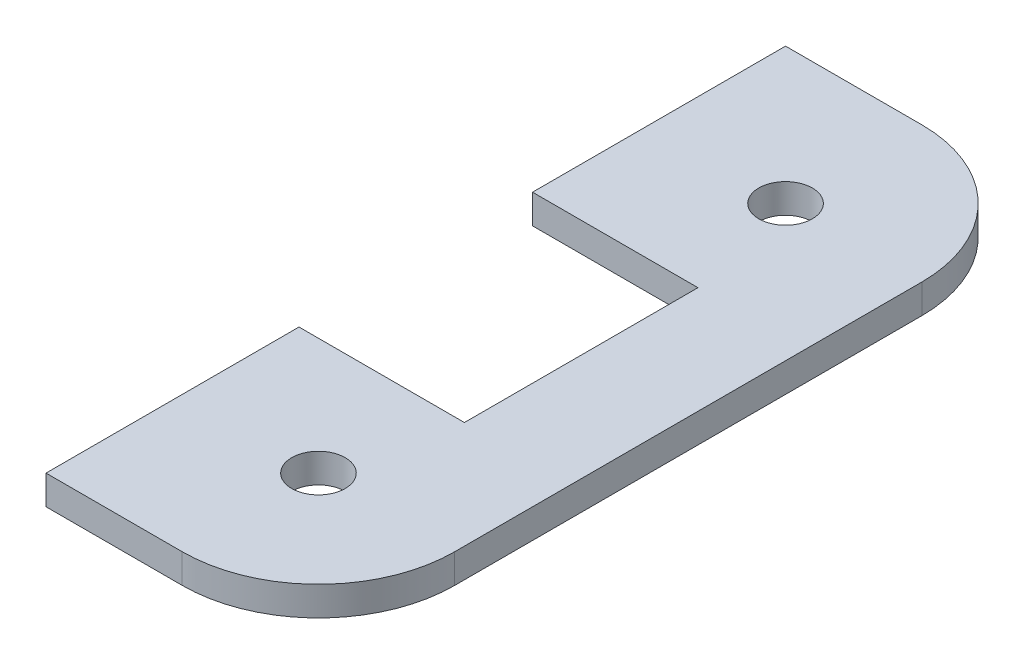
ISO-10303-21;
HEADER;
FILE_DESCRIPTION(('STEP AP214'),'2;1');
FILE_NAME('part.step','',(''),(''),'','','');
FILE_SCHEMA(('AUTOMOTIVE_DESIGN { 1 0 10303 214 1 1 1 1 }'));
ENDSEC;
DATA;
#1=APPLICATION_CONTEXT('core data for automotive mechanical design processes');
#2=APPLICATION_PROTOCOL_DEFINITION('international standard','automotive_design',2000,#1);
#3=PRODUCT_CONTEXT('',#1,'mechanical');
#4=PRODUCT('Part','Part','',(#3));
#5=PRODUCT_RELATED_PRODUCT_CATEGORY('part','',(#4));
#6=PRODUCT_DEFINITION_FORMATION('','',#4);
#7=PRODUCT_DEFINITION_CONTEXT('part definition',#1,'design');
#8=PRODUCT_DEFINITION('design','',#6,#7);
#9=PRODUCT_DEFINITION_SHAPE('','',#8);
#10=(LENGTH_UNIT() NAMED_UNIT(*) SI_UNIT(.MILLI.,.METRE.));
#11=(NAMED_UNIT(*) PLANE_ANGLE_UNIT() SI_UNIT($,.RADIAN.));
#12=(NAMED_UNIT(*) SI_UNIT($,.STERADIAN.) SOLID_ANGLE_UNIT());
#13=UNCERTAINTY_MEASURE_WITH_UNIT(LENGTH_MEASURE(1.E-05),#10,'distance_accuracy_value','');
#14=(GEOMETRIC_REPRESENTATION_CONTEXT(3) GLOBAL_UNCERTAINTY_ASSIGNED_CONTEXT((#13)) GLOBAL_UNIT_ASSIGNED_CONTEXT((#10,
#11,#12)) REPRESENTATION_CONTEXT('',''));
#15=CARTESIAN_POINT('',(0.,0.,0.));
#16=DIRECTION('',(0.,0.,1.));
#17=DIRECTION('',(1.,0.,0.));
#18=AXIS2_PLACEMENT_3D('',#15,#16,#17);
#19=CARTESIAN_POINT('',(14.,3.,-62.));
#20=DIRECTION('',(0.,1.,0.));
#21=DIRECTION('',(0.,0.,1.));
#22=AXIS2_PLACEMENT_3D('',#19,#20,#21);
#23=PLANE('',#22);
#24=CARTESIAN_POINT('',(14.,3.,-14.));
#25=DIRECTION('',(0.,1.,0.));
#26=DIRECTION('',(0.,0.,-1.));
#27=AXIS2_PLACEMENT_3D('',#24,#25,#26);
#28=CIRCLE('',#27,2.74999999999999);
#29=CARTESIAN_POINT('',(14.,3.,-16.75));
#30=VERTEX_POINT('',#29);
#31=EDGE_CURVE('E144',#30,#30,#28,.T.);
#32=ORIENTED_EDGE('',*,*,#31,.F.);
#33=EDGE_LOOP('',(#32));
#34=FACE_BOUND('',#33,.T.);
#35=DIRECTION('',(1.,0.,0.));
#36=VECTOR('',#35,1.);
#37=CARTESIAN_POINT('',(13.9999999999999,3.,0.));
#38=LINE('',#37,#36);
#39=CARTESIAN_POINT('',(0.,3.,0.));
#40=VERTEX_POINT('',#39);
#41=CARTESIAN_POINT('',(13.9999999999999,3.,0.));
#42=VERTEX_POINT('',#41);
#43=EDGE_CURVE('E159',#40,#42,#38,.T.);
#44=ORIENTED_EDGE('',*,*,#43,.T.);
#45=CARTESIAN_POINT('',(14.,3.,-14.));
#46=DIRECTION('',(0.,1.,0.));
#47=DIRECTION('',(0.,0.,1.));
#48=AXIS2_PLACEMENT_3D('',#45,#46,#47);
#49=CIRCLE('',#48,14.);
#50=CARTESIAN_POINT('',(28.,3.,-14.));
#51=VERTEX_POINT('',#50);
#52=EDGE_CURVE('E97',#42,#51,#49,.T.);
#53=ORIENTED_EDGE('',*,*,#52,.T.);
#54=DIRECTION('',(0.,0.,-1.));
#55=VECTOR('',#54,1.);
#56=CARTESIAN_POINT('',(28.,3.,-14.));
#57=LINE('',#56,#55);
#58=CARTESIAN_POINT('',(28.,3.,-61.9999999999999));
#59=VERTEX_POINT('',#58);
#60=EDGE_CURVE('E180',#51,#59,#57,.T.);
#61=ORIENTED_EDGE('',*,*,#60,.T.);
#62=CARTESIAN_POINT('',(14.,3.,-62.));
#63=DIRECTION('',(0.,1.,0.));
#64=DIRECTION('',(0.,0.,1.));
#65=AXIS2_PLACEMENT_3D('',#62,#63,#64);
#66=CIRCLE('',#65,14.);
#67=CARTESIAN_POINT('',(14.,3.,-75.9999999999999));
#68=VERTEX_POINT('',#67);
#69=EDGE_CURVE('E199',#59,#68,#66,.T.);
#70=ORIENTED_EDGE('',*,*,#69,.T.);
#71=DIRECTION('',(-1.,0.,0.));
#72=VECTOR('',#71,1.);
#73=CARTESIAN_POINT('',(14.,3.,-75.9999999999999));
#74=LINE('',#73,#72);
#75=CARTESIAN_POINT('',(0.,3.,-75.9999999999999));
#76=VERTEX_POINT('',#75);
#77=EDGE_CURVE('E196',#68,#76,#74,.T.);
#78=ORIENTED_EDGE('',*,*,#77,.T.);
#79=DIRECTION('',(0.,0.,1.));
#80=VECTOR('',#79,1.);
#81=CARTESIAN_POINT('',(0.,3.,-50.));
#82=LINE('',#81,#80);
#83=CARTESIAN_POINT('',(0.,3.,-50.));
#84=VERTEX_POINT('',#83);
#85=EDGE_CURVE('E198',#76,#84,#82,.T.);
#86=ORIENTED_EDGE('',*,*,#85,.T.);
#87=DIRECTION('',(1.,0.,0.));
#88=VECTOR('',#87,1.);
#89=CARTESIAN_POINT('',(0.,3.,-50.));
#90=LINE('',#89,#88);
#91=CARTESIAN_POINT('',(17.,3.,-50.));
#92=VERTEX_POINT('',#91);
#93=EDGE_CURVE('E122',#84,#92,#90,.T.);
#94=ORIENTED_EDGE('',*,*,#93,.T.);
#95=DIRECTION('',(0.,0.,1.));
#96=VECTOR('',#95,1.);
#97=CARTESIAN_POINT('',(17.,3.,-50.));
#98=LINE('',#97,#96);
#99=CARTESIAN_POINT('',(17.,3.,-26.));
#100=VERTEX_POINT('',#99);
#101=EDGE_CURVE('E116',#92,#100,#98,.T.);
#102=ORIENTED_EDGE('',*,*,#101,.T.);
#103=DIRECTION('',(-1.,0.,0.));
#104=VECTOR('',#103,1.);
#105=CARTESIAN_POINT('',(0.,3.,-26.));
#106=LINE('',#105,#104);
#107=CARTESIAN_POINT('',(0.,3.,-26.));
#108=VERTEX_POINT('',#107);
#109=EDGE_CURVE('E120',#100,#108,#106,.T.);
#110=ORIENTED_EDGE('',*,*,#109,.T.);
#111=DIRECTION('',(0.,0.,1.));
#112=VECTOR('',#111,1.);
#113=CARTESIAN_POINT('',(0.,3.,0.));
#114=LINE('',#113,#112);
#115=EDGE_CURVE('E48',#108,#40,#114,.T.);
#116=ORIENTED_EDGE('',*,*,#115,.T.);
#117=EDGE_LOOP('',(#44,#53,#61,#70,#78,#86,#94,#102,#110,#116));
#118=FACE_BOUND('',#117,.T.);
#119=CARTESIAN_POINT('',(14.,3.,-62.));
#120=DIRECTION('',(0.,1.,0.));
#121=DIRECTION('',(0.,0.,-1.));
#122=AXIS2_PLACEMENT_3D('',#119,#120,#121);
#123=CIRCLE('',#122,2.74999999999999);
#124=CARTESIAN_POINT('',(14.,3.,-64.75));
#125=VERTEX_POINT('',#124);
#126=EDGE_CURVE('E210',#125,#125,#123,.T.);
#127=ORIENTED_EDGE('',*,*,#126,.F.);
#128=EDGE_LOOP('',(#127));
#129=FACE_BOUND('',#128,.T.);
#130=ADVANCED_FACE('F31',(#34,#118,#129),#23,.T.);
#131=CARTESIAN_POINT('',(14.,0.,-62.));
#132=DIRECTION('',(0.,1.,0.));
#133=DIRECTION('',(0.,0.,1.));
#134=AXIS2_PLACEMENT_3D('',#131,#132,#133);
#135=PLANE('',#134);
#136=CARTESIAN_POINT('',(14.,0.,-14.));
#137=DIRECTION('',(0.,1.,0.));
#138=DIRECTION('',(0.,0.,-1.));
#139=AXIS2_PLACEMENT_3D('',#136,#137,#138);
#140=CIRCLE('',#139,2.74999999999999);
#141=CARTESIAN_POINT('',(14.,0.,-16.75));
#142=VERTEX_POINT('',#141);
#143=EDGE_CURVE('E207',#142,#142,#140,.T.);
#144=ORIENTED_EDGE('',*,*,#143,.T.);
#145=EDGE_LOOP('',(#144));
#146=FACE_BOUND('',#145,.T.);
#147=DIRECTION('',(1.,0.,0.));
#148=VECTOR('',#147,1.);
#149=CARTESIAN_POINT('',(13.9999999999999,0.,0.));
#150=LINE('',#149,#148);
#151=CARTESIAN_POINT('',(0.,0.,0.));
#152=VERTEX_POINT('',#151);
#153=CARTESIAN_POINT('',(13.9999999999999,0.,0.));
#154=VERTEX_POINT('',#153);
#155=EDGE_CURVE('E140',#152,#154,#150,.T.);
#156=ORIENTED_EDGE('',*,*,#155,.F.);
#157=DIRECTION('',(0.,0.,1.));
#158=VECTOR('',#157,1.);
#159=CARTESIAN_POINT('',(0.,0.,0.));
#160=LINE('',#159,#158);
#161=CARTESIAN_POINT('',(0.,0.,-26.));
#162=VERTEX_POINT('',#161);
#163=EDGE_CURVE('E89',#162,#152,#160,.T.);
#164=ORIENTED_EDGE('',*,*,#163,.F.);
#165=DIRECTION('',(-1.,0.,0.));
#166=VECTOR('',#165,1.);
#167=CARTESIAN_POINT('',(0.,0.,-26.));
#168=LINE('',#167,#166);
#169=CARTESIAN_POINT('',(17.,0.,-26.));
#170=VERTEX_POINT('',#169);
#171=EDGE_CURVE('E83',#170,#162,#168,.T.);
#172=ORIENTED_EDGE('',*,*,#171,.F.);
#173=DIRECTION('',(0.,0.,1.));
#174=VECTOR('',#173,1.);
#175=CARTESIAN_POINT('',(17.,0.,-50.));
#176=LINE('',#175,#174);
#177=CARTESIAN_POINT('',(17.,0.,-50.));
#178=VERTEX_POINT('',#177);
#179=EDGE_CURVE('E130',#178,#170,#176,.T.);
#180=ORIENTED_EDGE('',*,*,#179,.F.);
#181=DIRECTION('',(1.,0.,0.));
#182=VECTOR('',#181,1.);
#183=CARTESIAN_POINT('',(0.,0.,-50.));
#184=LINE('',#183,#182);
#185=CARTESIAN_POINT('',(0.,0.,-50.));
#186=VERTEX_POINT('',#185);
#187=EDGE_CURVE('E154',#186,#178,#184,.T.);
#188=ORIENTED_EDGE('',*,*,#187,.F.);
#189=DIRECTION('',(0.,0.,1.));
#190=VECTOR('',#189,1.);
#191=CARTESIAN_POINT('',(0.,0.,-50.));
#192=LINE('',#191,#190);
#193=CARTESIAN_POINT('',(0.,0.,-75.9999999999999));
#194=VERTEX_POINT('',#193);
#195=EDGE_CURVE('E152',#194,#186,#192,.T.);
#196=ORIENTED_EDGE('',*,*,#195,.F.);
#197=DIRECTION('',(-1.,0.,0.));
#198=VECTOR('',#197,1.);
#199=CARTESIAN_POINT('',(14.,0.,-75.9999999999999));
#200=LINE('',#199,#198);
#201=CARTESIAN_POINT('',(14.,0.,-75.9999999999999));
#202=VERTEX_POINT('',#201);
#203=EDGE_CURVE('E150',#202,#194,#200,.T.);
#204=ORIENTED_EDGE('',*,*,#203,.F.);
#205=CARTESIAN_POINT('',(14.,0.,-62.));
#206=DIRECTION('',(0.,1.,0.));
#207=DIRECTION('',(0.,0.,1.));
#208=AXIS2_PLACEMENT_3D('',#205,#206,#207);
#209=CIRCLE('',#208,14.);
#210=CARTESIAN_POINT('',(28.,0.,-61.9999999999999));
#211=VERTEX_POINT('',#210);
#212=EDGE_CURVE('E148',#211,#202,#209,.T.);
#213=ORIENTED_EDGE('',*,*,#212,.F.);
#214=DIRECTION('',(0.,0.,-1.));
#215=VECTOR('',#214,1.);
#216=CARTESIAN_POINT('',(28.,0.,-14.));
#217=LINE('',#216,#215);
#218=CARTESIAN_POINT('',(28.,0.,-14.));
#219=VERTEX_POINT('',#218);
#220=EDGE_CURVE('E146',#219,#211,#217,.T.);
#221=ORIENTED_EDGE('',*,*,#220,.F.);
#222=CARTESIAN_POINT('',(14.,0.,-14.));
#223=DIRECTION('',(0.,1.,0.));
#224=DIRECTION('',(0.,0.,1.));
#225=AXIS2_PLACEMENT_3D('',#222,#223,#224);
#226=CIRCLE('',#225,14.);
#227=EDGE_CURVE('E143',#154,#219,#226,.T.);
#228=ORIENTED_EDGE('',*,*,#227,.F.);
#229=EDGE_LOOP('',(#156,#164,#172,#180,#188,#196,#204,#213,#221,#228));
#230=FACE_BOUND('',#229,.T.);
#231=CARTESIAN_POINT('',(14.,0.,-62.));
#232=DIRECTION('',(0.,1.,0.));
#233=DIRECTION('',(0.,0.,-1.));
#234=AXIS2_PLACEMENT_3D('',#231,#232,#233);
#235=CIRCLE('',#234,2.74999999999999);
#236=CARTESIAN_POINT('',(14.,0.,-64.75));
#237=VERTEX_POINT('',#236);
#238=EDGE_CURVE('E213',#237,#237,#235,.T.);
#239=ORIENTED_EDGE('',*,*,#238,.T.);
#240=EDGE_LOOP('',(#239));
#241=FACE_BOUND('',#240,.T.);
#242=ADVANCED_FACE('F184',(#146,#230,#241),#135,.F.);
#243=CARTESIAN_POINT('',(13.9999999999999,3.,0.));
#244=DIRECTION('',(0.,0.,-1.));
#245=DIRECTION('',(-1.,0.,0.));
#246=AXIS2_PLACEMENT_3D('',#243,#244,#245);
#247=PLANE('',#246);
#248=ORIENTED_EDGE('',*,*,#155,.T.);
#249=DIRECTION('',(0.,-1.,0.));
#250=VECTOR('',#249,1.);
#251=CARTESIAN_POINT('',(13.9999999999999,3.,0.));
#252=LINE('',#251,#250);
#253=EDGE_CURVE('E11',#42,#154,#252,.T.);
#254=ORIENTED_EDGE('',*,*,#253,.F.);
#255=ORIENTED_EDGE('',*,*,#43,.F.);
#256=DIRECTION('',(0.,-1.,0.));
#257=VECTOR('',#256,1.);
#258=CARTESIAN_POINT('',(0.,3.,0.));
#259=LINE('',#258,#257);
#260=EDGE_CURVE('E136',#40,#152,#259,.T.);
#261=ORIENTED_EDGE('',*,*,#260,.T.);
#262=EDGE_LOOP('',(#248,#254,#255,#261));
#263=FACE_BOUND('',#262,.T.);
#264=ADVANCED_FACE('F33',(#263),#247,.F.);
#265=CARTESIAN_POINT('',(14.,3.,-14.));
#266=DIRECTION('',(0.,-1.,0.));
#267=DIRECTION('',(0.,0.,-1.));
#268=AXIS2_PLACEMENT_3D('',#265,#266,#267);
#269=CYLINDRICAL_SURFACE('',#268,14.);
#270=ORIENTED_EDGE('',*,*,#227,.T.);
#271=DIRECTION('',(0.,-1.,0.));
#272=VECTOR('',#271,1.);
#273=CARTESIAN_POINT('',(28.,3.,-14.));
#274=LINE('',#273,#272);
#275=EDGE_CURVE('E40',#51,#219,#274,.T.);
#276=ORIENTED_EDGE('',*,*,#275,.F.);
#277=ORIENTED_EDGE('',*,*,#52,.F.);
#278=ORIENTED_EDGE('',*,*,#253,.T.);
#279=EDGE_LOOP('',(#270,#276,#277,#278));
#280=FACE_BOUND('',#279,.T.);
#281=ADVANCED_FACE('F254',(#280),#269,.T.);
#282=CARTESIAN_POINT('',(28.,3.,-14.));
#283=DIRECTION('',(-1.,0.,0.));
#284=DIRECTION('',(0.,0.,1.));
#285=AXIS2_PLACEMENT_3D('',#282,#283,#284);
#286=PLANE('',#285);
#287=ORIENTED_EDGE('',*,*,#220,.T.);
#288=DIRECTION('',(0.,-1.,0.));
#289=VECTOR('',#288,1.);
#290=CARTESIAN_POINT('',(28.,3.,-61.9999999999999));
#291=LINE('',#290,#289);
#292=EDGE_CURVE('E172',#59,#211,#291,.T.);
#293=ORIENTED_EDGE('',*,*,#292,.F.);
#294=ORIENTED_EDGE('',*,*,#60,.F.);
#295=ORIENTED_EDGE('',*,*,#275,.T.);
#296=EDGE_LOOP('',(#287,#293,#294,#295));
#297=FACE_BOUND('',#296,.T.);
#298=ADVANCED_FACE('F178',(#297),#286,.F.);
#299=CARTESIAN_POINT('',(14.,3.,-62.));
#300=DIRECTION('',(0.,-1.,0.));
#301=DIRECTION('',(0.,0.,-1.));
#302=AXIS2_PLACEMENT_3D('',#299,#300,#301);
#303=CYLINDRICAL_SURFACE('',#302,14.);
#304=ORIENTED_EDGE('',*,*,#212,.T.);
#305=DIRECTION('',(0.,-1.,0.));
#306=VECTOR('',#305,1.);
#307=CARTESIAN_POINT('',(14.,3.,-75.9999999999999));
#308=LINE('',#307,#306);
#309=EDGE_CURVE('E169',#68,#202,#308,.T.);
#310=ORIENTED_EDGE('',*,*,#309,.F.);
#311=ORIENTED_EDGE('',*,*,#69,.F.);
#312=ORIENTED_EDGE('',*,*,#292,.T.);
#313=EDGE_LOOP('',(#304,#310,#311,#312));
#314=FACE_BOUND('',#313,.T.);
#315=ADVANCED_FACE('F190',(#314),#303,.T.);
#316=CARTESIAN_POINT('',(14.,3.,-75.9999999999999));
#317=DIRECTION('',(0.,0.,1.));
#318=DIRECTION('',(1.,0.,0.));
#319=AXIS2_PLACEMENT_3D('',#316,#317,#318);
#320=PLANE('',#319);
#321=ORIENTED_EDGE('',*,*,#203,.T.);
#322=DIRECTION('',(0.,-1.,0.));
#323=VECTOR('',#322,1.);
#324=CARTESIAN_POINT('',(0.,3.,-75.9999999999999));
#325=LINE('',#324,#323);
#326=EDGE_CURVE('E166',#76,#194,#325,.T.);
#327=ORIENTED_EDGE('',*,*,#326,.F.);
#328=ORIENTED_EDGE('',*,*,#77,.F.);
#329=ORIENTED_EDGE('',*,*,#309,.T.);
#330=EDGE_LOOP('',(#321,#327,#328,#329));
#331=FACE_BOUND('',#330,.T.);
#332=ADVANCED_FACE('F194',(#331),#320,.F.);
#333=CARTESIAN_POINT('',(0.,3.,-50.));
#334=DIRECTION('',(1.,0.,0.));
#335=DIRECTION('',(0.,0.,-1.));
#336=AXIS2_PLACEMENT_3D('',#333,#334,#335);
#337=PLANE('',#336);
#338=ORIENTED_EDGE('',*,*,#195,.T.);
#339=DIRECTION('',(0.,-1.,0.));
#340=VECTOR('',#339,1.);
#341=CARTESIAN_POINT('',(0.,3.,-50.));
#342=LINE('',#341,#340);
#343=EDGE_CURVE('E163',#84,#186,#342,.T.);
#344=ORIENTED_EDGE('',*,*,#343,.F.);
#345=ORIENTED_EDGE('',*,*,#85,.F.);
#346=ORIENTED_EDGE('',*,*,#326,.T.);
#347=EDGE_LOOP('',(#338,#344,#345,#346));
#348=FACE_BOUND('',#347,.T.);
#349=ADVANCED_FACE('F244',(#348),#337,.F.);
#350=CARTESIAN_POINT('',(0.,3.,-50.));
#351=DIRECTION('',(0.,0.,-1.));
#352=DIRECTION('',(-1.,0.,0.));
#353=AXIS2_PLACEMENT_3D('',#350,#351,#352);
#354=PLANE('',#353);
#355=ORIENTED_EDGE('',*,*,#187,.T.);
#356=DIRECTION('',(0.,-1.,0.));
#357=VECTOR('',#356,1.);
#358=CARTESIAN_POINT('',(17.,3.,-50.));
#359=LINE('',#358,#357);
#360=EDGE_CURVE('E131',#92,#178,#359,.T.);
#361=ORIENTED_EDGE('',*,*,#360,.F.);
#362=ORIENTED_EDGE('',*,*,#93,.F.);
#363=ORIENTED_EDGE('',*,*,#343,.T.);
#364=EDGE_LOOP('',(#355,#361,#362,#363));
#365=FACE_BOUND('',#364,.T.);
#366=ADVANCED_FACE('F241',(#365),#354,.F.);
#367=CARTESIAN_POINT('',(17.,3.,-50.));
#368=DIRECTION('',(1.,0.,0.));
#369=DIRECTION('',(0.,0.,-1.));
#370=AXIS2_PLACEMENT_3D('',#367,#368,#369);
#371=PLANE('',#370);
#372=ORIENTED_EDGE('',*,*,#179,.T.);
#373=DIRECTION('',(0.,-1.,0.));
#374=VECTOR('',#373,1.);
#375=CARTESIAN_POINT('',(17.,3.,-26.));
#376=LINE('',#375,#374);
#377=EDGE_CURVE('E127',#100,#170,#376,.T.);
#378=ORIENTED_EDGE('',*,*,#377,.F.);
#379=ORIENTED_EDGE('',*,*,#101,.F.);
#380=ORIENTED_EDGE('',*,*,#360,.T.);
#381=EDGE_LOOP('',(#372,#378,#379,#380));
#382=FACE_BOUND('',#381,.T.);
#383=ADVANCED_FACE('F128',(#382),#371,.F.);
#384=CARTESIAN_POINT('',(0.,3.,-26.));
#385=DIRECTION('',(0.,0.,1.));
#386=DIRECTION('',(1.,0.,0.));
#387=AXIS2_PLACEMENT_3D('',#384,#385,#386);
#388=PLANE('',#387);
#389=ORIENTED_EDGE('',*,*,#171,.T.);
#390=DIRECTION('',(0.,-1.,0.));
#391=VECTOR('',#390,1.);
#392=CARTESIAN_POINT('',(0.,3.,-26.));
#393=LINE('',#392,#391);
#394=EDGE_CURVE('E132',#108,#162,#393,.T.);
#395=ORIENTED_EDGE('',*,*,#394,.F.);
#396=ORIENTED_EDGE('',*,*,#109,.F.);
#397=ORIENTED_EDGE('',*,*,#377,.T.);
#398=EDGE_LOOP('',(#389,#395,#396,#397));
#399=FACE_BOUND('',#398,.T.);
#400=ADVANCED_FACE('F134',(#399),#388,.F.);
#401=CARTESIAN_POINT('',(0.,3.,0.));
#402=DIRECTION('',(1.,0.,0.));
#403=DIRECTION('',(0.,0.,-1.));
#404=AXIS2_PLACEMENT_3D('',#401,#402,#403);
#405=PLANE('',#404);
#406=ORIENTED_EDGE('',*,*,#163,.T.);
#407=ORIENTED_EDGE('',*,*,#260,.F.);
#408=ORIENTED_EDGE('',*,*,#115,.F.);
#409=ORIENTED_EDGE('',*,*,#394,.T.);
#410=EDGE_LOOP('',(#406,#407,#408,#409));
#411=FACE_BOUND('',#410,.T.);
#412=ADVANCED_FACE('F234',(#411),#405,.F.);
#413=CARTESIAN_POINT('',(14.,3.,-14.));
#414=DIRECTION('',(0.,-1.,0.));
#415=DIRECTION('',(0.,0.,-1.));
#416=AXIS2_PLACEMENT_3D('',#413,#414,#415);
#417=CYLINDRICAL_SURFACE('',#416,2.74999999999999);
#418=ORIENTED_EDGE('',*,*,#31,.T.);
#419=EDGE_LOOP('',(#418));
#420=FACE_BOUND('',#419,.T.);
#421=ORIENTED_EDGE('',*,*,#143,.F.);
#422=EDGE_LOOP('',(#421));
#423=FACE_BOUND('',#422,.T.);
#424=ADVANCED_FACE('F231',(#420,#423),#417,.F.);
#425=CARTESIAN_POINT('',(14.,3.,-62.));
#426=DIRECTION('',(0.,-1.,0.));
#427=DIRECTION('',(0.,0.,-1.));
#428=AXIS2_PLACEMENT_3D('',#425,#426,#427);
#429=CYLINDRICAL_SURFACE('',#428,2.74999999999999);
#430=ORIENTED_EDGE('',*,*,#126,.T.);
#431=EDGE_LOOP('',(#430));
#432=FACE_BOUND('',#431,.T.);
#433=ORIENTED_EDGE('',*,*,#238,.F.);
#434=EDGE_LOOP('',(#433));
#435=FACE_BOUND('',#434,.T.);
#436=ADVANCED_FACE('F219',(#432,#435),#429,.F.);
#437=CLOSED_SHELL('',(#130,#242,#264,#281,#298,#315,#332,#349,#366,#383,#400,#412,#424,#436));
#438=MANIFOLD_SOLID_BREP('B2',#437);
#439=ADVANCED_BREP_SHAPE_REPRESENTATION('',(#18,#438),#14);
#440=SHAPE_DEFINITION_REPRESENTATION(#9,#439);
ENDSEC;
END-ISO-10303-21;
